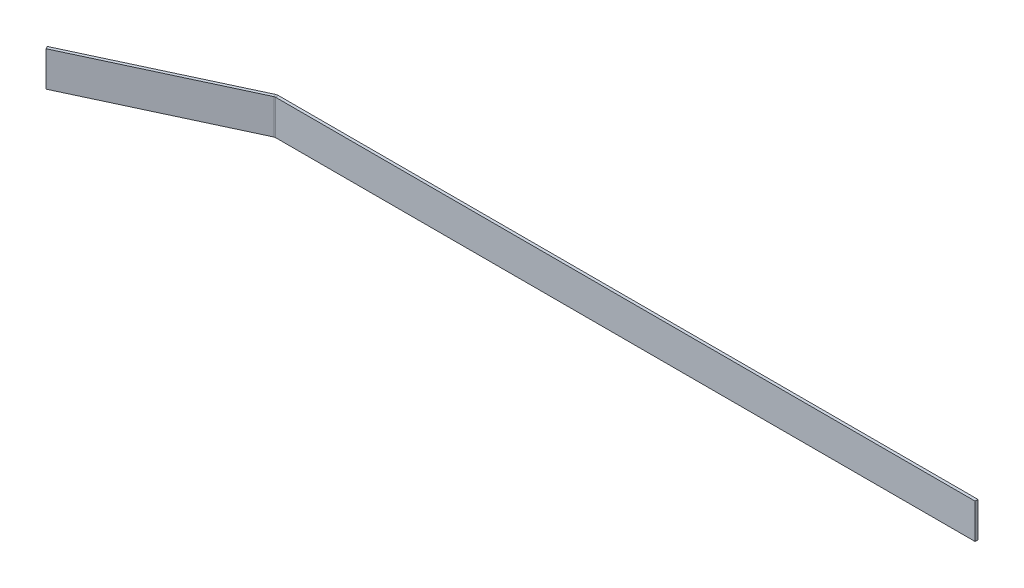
ISO-10303-21;
HEADER;
FILE_DESCRIPTION(('STEP AP214'),'2;1');
FILE_NAME('part.step','',(''),(''),'','','');
FILE_SCHEMA(('AUTOMOTIVE_DESIGN { 1 0 10303 214 1 1 1 1 }'));
ENDSEC;
DATA;
#1=APPLICATION_CONTEXT('core data for automotive mechanical design processes');
#2=APPLICATION_PROTOCOL_DEFINITION('international standard','automotive_design',2000,#1);
#3=PRODUCT_CONTEXT('',#1,'mechanical');
#4=PRODUCT('Part','Part','',(#3));
#5=PRODUCT_RELATED_PRODUCT_CATEGORY('part','',(#4));
#6=PRODUCT_DEFINITION_FORMATION('','',#4);
#7=PRODUCT_DEFINITION_CONTEXT('part definition',#1,'design');
#8=PRODUCT_DEFINITION('design','',#6,#7);
#9=PRODUCT_DEFINITION_SHAPE('','',#8);
#10=(LENGTH_UNIT() NAMED_UNIT(*) SI_UNIT(.MILLI.,.METRE.));
#11=(NAMED_UNIT(*) PLANE_ANGLE_UNIT() SI_UNIT($,.RADIAN.));
#12=(NAMED_UNIT(*) SI_UNIT($,.STERADIAN.) SOLID_ANGLE_UNIT());
#13=UNCERTAINTY_MEASURE_WITH_UNIT(LENGTH_MEASURE(1.E-05),#10,'distance_accuracy_value','');
#14=(GEOMETRIC_REPRESENTATION_CONTEXT(3) GLOBAL_UNCERTAINTY_ASSIGNED_CONTEXT((#13)) GLOBAL_UNIT_ASSIGNED_CONTEXT((#10,
#11,#12)) REPRESENTATION_CONTEXT('',''));
#15=CARTESIAN_POINT('',(0.,0.,0.));
#16=DIRECTION('',(0.,0.,1.));
#17=DIRECTION('',(1.,0.,0.));
#18=AXIS2_PLACEMENT_3D('',#15,#16,#17);
#19=CARTESIAN_POINT('',(1.40776110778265,-76.2,0.));
#20=DIRECTION('',(0.,-1.,0.));
#21=DIRECTION('',(0.,0.,-1.));
#22=AXIS2_PLACEMENT_3D('',#19,#20,#21);
#23=PLANE('',#22);
#24=DIRECTION('',(0.,0.,-1.));
#25=VECTOR('',#24,1.);
#26=CARTESIAN_POINT('',(1.40776110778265,-76.2,0.));
#27=LINE('',#26,#25);
#28=CARTESIAN_POINT('',(1.40776110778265,-76.2,0.));
#29=VERTEX_POINT('',#28);
#30=CARTESIAN_POINT('',(1.40776110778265,-76.2,-6.35));
#31=VERTEX_POINT('',#30);
#32=EDGE_CURVE('E11',#29,#31,#27,.T.);
#33=ORIENTED_EDGE('',*,*,#32,.F.);
#34=CARTESIAN_POINT('',(1.40776110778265,-76.2,6.35));
#35=DIRECTION('',(0.,-1.,0.));
#36=DIRECTION('',(0.,0.,-1.));
#37=AXIS2_PLACEMENT_3D('',#34,#35,#36);
#38=CIRCLE('',#37,6.35);
#39=CARTESIAN_POINT('',(-1.27586485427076,-76.2,0.594945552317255));
#40=VERTEX_POINT('',#39);
#41=EDGE_CURVE('E182',#29,#40,#38,.F.);
#42=ORIENTED_EDGE('',*,*,#41,.T.);
#43=DIRECTION('',(0.422618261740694,0.,0.906307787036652));
#44=VECTOR('',#43,1.);
#45=CARTESIAN_POINT('',(-3.95949081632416,-76.2,-5.16010889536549));
#46=LINE('',#45,#44);
#47=CARTESIAN_POINT('',(-3.95949081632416,-76.2,-5.16010889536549));
#48=VERTEX_POINT('',#47);
#49=EDGE_CURVE('E46',#48,#40,#46,.T.);
#50=ORIENTED_EDGE('',*,*,#49,.F.);
#51=CARTESIAN_POINT('',(1.40776110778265,-76.2,6.35));
#52=DIRECTION('',(0.,1.,0.));
#53=DIRECTION('',(1.,0.,0.));
#54=AXIS2_PLACEMENT_3D('',#51,#52,#53);
#55=CIRCLE('',#54,12.7);
#56=EDGE_CURVE('E135',#31,#48,#55,.T.);
#57=ORIENTED_EDGE('',*,*,#56,.F.);
#58=EDGE_LOOP('',(#33,#42,#50,#57));
#59=FACE_BOUND('',#58,.T.);
#60=ADVANCED_FACE('F38',(#59),#23,.T.);
#61=CARTESIAN_POINT('',(-3.95949081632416,-76.2,-5.16010889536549));
#62=DIRECTION('',(0.,-1.,0.));
#63=DIRECTION('',(0.,0.,-1.));
#64=AXIS2_PLACEMENT_3D('',#61,#62,#63);
#65=PLANE('',#64);
#66=DIRECTION('',(-1.,0.,0.));
#67=VECTOR('',#66,1.);
#68=CARTESIAN_POINT('',(0.,-76.2,0.));
#69=LINE('',#68,#67);
#70=CARTESIAN_POINT('',(1524.,-76.2,0.));
#71=VERTEX_POINT('',#70);
#72=EDGE_CURVE('E131',#71,#29,#69,.T.);
#73=ORIENTED_EDGE('',*,*,#72,.T.);
#74=ORIENTED_EDGE('',*,*,#32,.T.);
#75=DIRECTION('',(1.,0.,0.));
#76=VECTOR('',#75,1.);
#77=CARTESIAN_POINT('',(0.,-76.2,-6.35));
#78=LINE('',#77,#76);
#79=CARTESIAN_POINT('',(1524.,-76.2,-6.35));
#80=VERTEX_POINT('',#79);
#81=EDGE_CURVE('E116',#80,#31,#78,.F.);
#82=ORIENTED_EDGE('',*,*,#81,.F.);
#83=DIRECTION('',(0.,0.,1.));
#84=VECTOR('',#83,1.);
#85=CARTESIAN_POINT('',(1524.,-76.2,-6.35));
#86=LINE('',#85,#84);
#87=EDGE_CURVE('E125',#80,#71,#86,.T.);
#88=ORIENTED_EDGE('',*,*,#87,.T.);
#89=EDGE_LOOP('',(#73,#74,#82,#88));
#90=FACE_BOUND('',#89,.T.);
#91=ADVANCED_FACE('F133',(#90),#65,.T.);
#92=CARTESIAN_POINT('',(-1.27586485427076,0.,0.594945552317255));
#93=DIRECTION('',(0.,1.,0.));
#94=DIRECTION('',(0.,0.,1.));
#95=AXIS2_PLACEMENT_3D('',#92,#93,#94);
#96=PLANE('',#95);
#97=DIRECTION('',(-0.422618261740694,0.,-0.906307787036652));
#98=VECTOR('',#97,1.);
#99=CARTESIAN_POINT('',(-1.27586485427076,0.,0.594945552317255));
#100=LINE('',#99,#98);
#101=CARTESIAN_POINT('',(-1.27586485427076,0.,0.594945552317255));
#102=VERTEX_POINT('',#101);
#103=CARTESIAN_POINT('',(-3.95949081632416,0.,-5.16010889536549));
#104=VERTEX_POINT('',#103);
#105=EDGE_CURVE('E88',#102,#104,#100,.T.);
#106=ORIENTED_EDGE('',*,*,#105,.F.);
#107=CARTESIAN_POINT('',(1.40776110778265,0.,6.35));
#108=DIRECTION('',(0.,-1.,0.));
#109=DIRECTION('',(0.,0.,-1.));
#110=AXIS2_PLACEMENT_3D('',#107,#108,#109);
#111=CIRCLE('',#110,6.35);
#112=CARTESIAN_POINT('',(1.40776110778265,0.,0.));
#113=VERTEX_POINT('',#112);
#114=EDGE_CURVE('E149',#113,#102,#111,.F.);
#115=ORIENTED_EDGE('',*,*,#114,.F.);
#116=DIRECTION('',(0.,0.,1.));
#117=VECTOR('',#116,1.);
#118=CARTESIAN_POINT('',(1.40776110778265,0.,-6.35));
#119=LINE('',#118,#117);
#120=CARTESIAN_POINT('',(1.40776110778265,0.,-6.35));
#121=VERTEX_POINT('',#120);
#122=EDGE_CURVE('E81',#121,#113,#119,.T.);
#123=ORIENTED_EDGE('',*,*,#122,.F.);
#124=CARTESIAN_POINT('',(1.40776110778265,0.,6.35));
#125=DIRECTION('',(0.,1.,0.));
#126=DIRECTION('',(1.,0.,0.));
#127=AXIS2_PLACEMENT_3D('',#124,#125,#126);
#128=CIRCLE('',#127,12.7);
#129=EDGE_CURVE('E158',#121,#104,#128,.T.);
#130=ORIENTED_EDGE('',*,*,#129,.T.);
#131=EDGE_LOOP('',(#106,#115,#123,#130));
#132=FACE_BOUND('',#131,.T.);
#133=ADVANCED_FACE('F196',(#132),#96,.T.);
#134=CARTESIAN_POINT('',(1.40776110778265,0.,-6.35));
#135=DIRECTION('',(0.,1.,0.));
#136=DIRECTION('',(0.,0.,1.));
#137=AXIS2_PLACEMENT_3D('',#134,#135,#136);
#138=PLANE('',#137);
#139=DIRECTION('',(-0.906307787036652,0.,0.422618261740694));
#140=VECTOR('',#139,1.);
#141=CARTESIAN_POINT('',(0.,0.,0.));
#142=LINE('',#141,#140);
#143=CARTESIAN_POINT('',(-339.548212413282,0.,158.333931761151));
#144=VERTEX_POINT('',#143);
#145=EDGE_CURVE('E147',#102,#144,#142,.T.);
#146=ORIENTED_EDGE('',*,*,#145,.F.);
#147=ORIENTED_EDGE('',*,*,#105,.T.);
#148=DIRECTION('',(-0.906307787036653,0.,0.422618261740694));
#149=VECTOR('',#148,1.);
#150=CARTESIAN_POINT('',(-2.68362596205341,0.,-5.75505444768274));
#151=LINE('',#150,#149);
#152=CARTESIAN_POINT('',(-342.231838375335,0.,152.578877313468));
#153=VERTEX_POINT('',#152);
#154=EDGE_CURVE('E142',#104,#153,#151,.T.);
#155=ORIENTED_EDGE('',*,*,#154,.T.);
#156=DIRECTION('',(-0.422618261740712,0.,-0.906307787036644));
#157=VECTOR('',#156,1.);
#158=CARTESIAN_POINT('',(-339.548212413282,0.,158.333931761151));
#159=LINE('',#158,#157);
#160=EDGE_CURVE('E144',#144,#153,#159,.T.);
#161=ORIENTED_EDGE('',*,*,#160,.F.);
#162=EDGE_LOOP('',(#146,#147,#155,#161));
#163=FACE_BOUND('',#162,.T.);
#164=ADVANCED_FACE('F204',(#163),#138,.T.);
#165=CARTESIAN_POINT('',(-2.68362596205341,-76.2,-5.75505444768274));
#166=DIRECTION('',(-0.422618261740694,0.,-0.906307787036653));
#167=DIRECTION('',(-0.906307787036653,0.,0.422618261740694));
#168=AXIS2_PLACEMENT_3D('',#165,#166,#167);
#169=PLANE('',#168);
#170=ORIENTED_EDGE('',*,*,#154,.F.);
#171=DIRECTION('',(0.,1.,0.));
#172=VECTOR('',#171,1.);
#173=CARTESIAN_POINT('',(-3.95949081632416,-76.2,-5.16010889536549));
#174=LINE('',#173,#172);
#175=EDGE_CURVE('E161',#48,#104,#174,.T.);
#176=ORIENTED_EDGE('',*,*,#175,.F.);
#177=DIRECTION('',(-0.906307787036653,0.,0.422618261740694));
#178=VECTOR('',#177,1.);
#179=CARTESIAN_POINT('',(-2.68362596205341,-76.2,-5.75505444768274));
#180=LINE('',#179,#178);
#181=CARTESIAN_POINT('',(-342.231838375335,-76.2,152.578877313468));
#182=VERTEX_POINT('',#181);
#183=EDGE_CURVE('E160',#48,#182,#180,.T.);
#184=ORIENTED_EDGE('',*,*,#183,.T.);
#185=DIRECTION('',(0.,1.,0.));
#186=VECTOR('',#185,1.);
#187=CARTESIAN_POINT('',(-342.231838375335,-76.2,152.578877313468));
#188=LINE('',#187,#186);
#189=EDGE_CURVE('E138',#182,#153,#188,.T.);
#190=ORIENTED_EDGE('',*,*,#189,.T.);
#191=EDGE_LOOP('',(#170,#176,#184,#190));
#192=FACE_BOUND('',#191,.T.);
#193=ADVANCED_FACE('F202',(#192),#169,.T.);
#194=CARTESIAN_POINT('',(1.40776110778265,-76.2,6.35));
#195=DIRECTION('',(0.,1.,0.));
#196=DIRECTION('',(0.,0.,1.));
#197=AXIS2_PLACEMENT_3D('',#194,#195,#196);
#198=CYLINDRICAL_SURFACE('',#197,12.7);
#199=ORIENTED_EDGE('',*,*,#129,.F.);
#200=DIRECTION('',(0.,1.,0.));
#201=VECTOR('',#200,1.);
#202=CARTESIAN_POINT('',(1.40776110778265,-76.2,-6.35));
#203=LINE('',#202,#201);
#204=EDGE_CURVE('E121',#31,#121,#203,.T.);
#205=ORIENTED_EDGE('',*,*,#204,.F.);
#206=ORIENTED_EDGE('',*,*,#56,.T.);
#207=ORIENTED_EDGE('',*,*,#175,.T.);
#208=EDGE_LOOP('',(#199,#205,#206,#207));
#209=FACE_BOUND('',#208,.T.);
#210=ADVANCED_FACE('F199',(#209),#198,.T.);
#211=CARTESIAN_POINT('',(0.,-76.2,-6.35));
#212=DIRECTION('',(0.,0.,-1.));
#213=DIRECTION('',(-1.,0.,0.));
#214=AXIS2_PLACEMENT_3D('',#211,#212,#213);
#215=PLANE('',#214);
#216=DIRECTION('',(1.,0.,0.));
#217=VECTOR('',#216,1.);
#218=CARTESIAN_POINT('',(0.,0.,-6.35));
#219=LINE('',#218,#217);
#220=CARTESIAN_POINT('',(1524.,0.,-6.35));
#221=VERTEX_POINT('',#220);
#222=EDGE_CURVE('E118',#221,#121,#219,.F.);
#223=ORIENTED_EDGE('',*,*,#222,.F.);
#224=DIRECTION('',(0.,1.,0.));
#225=VECTOR('',#224,1.);
#226=CARTESIAN_POINT('',(1524.,-76.2,-6.35));
#227=LINE('',#226,#225);
#228=EDGE_CURVE('E112',#80,#221,#227,.T.);
#229=ORIENTED_EDGE('',*,*,#228,.F.);
#230=ORIENTED_EDGE('',*,*,#81,.T.);
#231=ORIENTED_EDGE('',*,*,#204,.T.);
#232=EDGE_LOOP('',(#223,#229,#230,#231));
#233=FACE_BOUND('',#232,.T.);
#234=ADVANCED_FACE('F114',(#233),#215,.T.);
#235=CARTESIAN_POINT('',(1524.,-76.2,-6.35));
#236=DIRECTION('',(-1.,0.,0.));
#237=DIRECTION('',(0.,0.,1.));
#238=AXIS2_PLACEMENT_3D('',#235,#236,#237);
#239=PLANE('',#238);
#240=DIRECTION('',(0.,0.,1.));
#241=VECTOR('',#240,1.);
#242=CARTESIAN_POINT('',(1524.,0.,-6.35));
#243=LINE('',#242,#241);
#244=CARTESIAN_POINT('',(1524.,0.,0.));
#245=VERTEX_POINT('',#244);
#246=EDGE_CURVE('E155',#221,#245,#243,.T.);
#247=ORIENTED_EDGE('',*,*,#246,.T.);
#248=DIRECTION('',(0.,1.,0.));
#249=VECTOR('',#248,1.);
#250=CARTESIAN_POINT('',(1524.,-76.2,0.));
#251=LINE('',#250,#249);
#252=EDGE_CURVE('E122',#71,#245,#251,.T.);
#253=ORIENTED_EDGE('',*,*,#252,.F.);
#254=ORIENTED_EDGE('',*,*,#87,.F.);
#255=ORIENTED_EDGE('',*,*,#228,.T.);
#256=EDGE_LOOP('',(#247,#253,#254,#255));
#257=FACE_BOUND('',#256,.T.);
#258=ADVANCED_FACE('F126',(#257),#239,.F.);
#259=CARTESIAN_POINT('',(0.,-76.2,0.));
#260=DIRECTION('',(0.,0.,-1.));
#261=DIRECTION('',(-1.,0.,0.));
#262=AXIS2_PLACEMENT_3D('',#259,#260,#261);
#263=PLANE('',#262);
#264=DIRECTION('',(-1.,0.,0.));
#265=VECTOR('',#264,1.);
#266=CARTESIAN_POINT('',(0.,0.,0.));
#267=LINE('',#266,#265);
#268=EDGE_CURVE('E152',#245,#113,#267,.T.);
#269=ORIENTED_EDGE('',*,*,#268,.T.);
#270=DIRECTION('',(0.,1.,0.));
#271=VECTOR('',#270,1.);
#272=CARTESIAN_POINT('',(1.40776110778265,-76.2,0.));
#273=LINE('',#272,#271);
#274=EDGE_CURVE('E165',#29,#113,#273,.T.);
#275=ORIENTED_EDGE('',*,*,#274,.F.);
#276=ORIENTED_EDGE('',*,*,#72,.F.);
#277=ORIENTED_EDGE('',*,*,#252,.T.);
#278=EDGE_LOOP('',(#269,#275,#276,#277));
#279=FACE_BOUND('',#278,.T.);
#280=ADVANCED_FACE('F194',(#279),#263,.F.);
#281=CARTESIAN_POINT('',(1.40776110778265,-76.2,6.35));
#282=DIRECTION('',(0.,1.,0.));
#283=DIRECTION('',(0.,0.,1.));
#284=AXIS2_PLACEMENT_3D('',#281,#282,#283);
#285=CYLINDRICAL_SURFACE('',#284,6.35);
#286=ORIENTED_EDGE('',*,*,#114,.T.);
#287=DIRECTION('',(0.,1.,0.));
#288=VECTOR('',#287,1.);
#289=CARTESIAN_POINT('',(-1.27586485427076,-76.2,0.594945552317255));
#290=LINE('',#289,#288);
#291=EDGE_CURVE('E168',#40,#102,#290,.T.);
#292=ORIENTED_EDGE('',*,*,#291,.F.);
#293=ORIENTED_EDGE('',*,*,#41,.F.);
#294=ORIENTED_EDGE('',*,*,#274,.T.);
#295=EDGE_LOOP('',(#286,#292,#293,#294));
#296=FACE_BOUND('',#295,.T.);
#297=ADVANCED_FACE('F186',(#296),#285,.F.);
#298=CARTESIAN_POINT('',(0.,-76.2,0.));
#299=DIRECTION('',(-0.422618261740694,0.,-0.906307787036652));
#300=DIRECTION('',(-0.906307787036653,0.,0.422618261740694));
#301=AXIS2_PLACEMENT_3D('',#298,#299,#300);
#302=PLANE('',#301);
#303=ORIENTED_EDGE('',*,*,#145,.T.);
#304=DIRECTION('',(0.,1.,0.));
#305=VECTOR('',#304,1.);
#306=CARTESIAN_POINT('',(-339.548212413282,-76.2,158.333931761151));
#307=LINE('',#306,#305);
#308=CARTESIAN_POINT('',(-339.548212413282,-76.2,158.333931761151));
#309=VERTEX_POINT('',#308);
#310=EDGE_CURVE('E171',#309,#144,#307,.T.);
#311=ORIENTED_EDGE('',*,*,#310,.F.);
#312=DIRECTION('',(-0.906307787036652,0.,0.422618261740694));
#313=VECTOR('',#312,1.);
#314=CARTESIAN_POINT('',(0.,-76.2,0.));
#315=LINE('',#314,#313);
#316=EDGE_CURVE('E178',#40,#309,#315,.T.);
#317=ORIENTED_EDGE('',*,*,#316,.F.);
#318=ORIENTED_EDGE('',*,*,#291,.T.);
#319=EDGE_LOOP('',(#303,#311,#317,#318));
#320=FACE_BOUND('',#319,.T.);
#321=ADVANCED_FACE('F188',(#320),#302,.F.);
#322=CARTESIAN_POINT('',(-339.548212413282,-76.2,158.333931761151));
#323=DIRECTION('',(0.906307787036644,0.,-0.422618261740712));
#324=DIRECTION('',(-0.422618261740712,0.,-0.906307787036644));
#325=AXIS2_PLACEMENT_3D('',#322,#323,#324);
#326=PLANE('',#325);
#327=ORIENTED_EDGE('',*,*,#160,.T.);
#328=ORIENTED_EDGE('',*,*,#189,.F.);
#329=DIRECTION('',(-0.422618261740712,0.,-0.906307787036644));
#330=VECTOR('',#329,1.);
#331=CARTESIAN_POINT('',(-339.548212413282,-76.2,158.333931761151));
#332=LINE('',#331,#330);
#333=EDGE_CURVE('E97',#309,#182,#332,.T.);
#334=ORIENTED_EDGE('',*,*,#333,.F.);
#335=ORIENTED_EDGE('',*,*,#310,.T.);
#336=EDGE_LOOP('',(#327,#328,#334,#335));
#337=FACE_BOUND('',#336,.T.);
#338=ADVANCED_FACE('F206',(#337),#326,.F.);
#339=CARTESIAN_POINT('',(1.40776110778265,-76.2,6.35));
#340=DIRECTION('',(0.,-1.,0.));
#341=DIRECTION('',(-1.,0.,0.));
#342=AXIS2_PLACEMENT_3D('',#339,#340,#341);
#343=PLANE('',#342);
#344=ORIENTED_EDGE('',*,*,#183,.F.);
#345=ORIENTED_EDGE('',*,*,#49,.T.);
#346=ORIENTED_EDGE('',*,*,#316,.T.);
#347=ORIENTED_EDGE('',*,*,#333,.T.);
#348=EDGE_LOOP('',(#344,#345,#346,#347));
#349=FACE_BOUND('',#348,.T.);
#350=ADVANCED_FACE('F176',(#349),#343,.T.);
#351=CARTESIAN_POINT('',(1.40776110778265,0.,6.35));
#352=DIRECTION('',(0.,-1.,0.));
#353=DIRECTION('',(-1.,0.,0.));
#354=AXIS2_PLACEMENT_3D('',#351,#352,#353);
#355=PLANE('',#354);
#356=ORIENTED_EDGE('',*,*,#222,.T.);
#357=ORIENTED_EDGE('',*,*,#122,.T.);
#358=ORIENTED_EDGE('',*,*,#268,.F.);
#359=ORIENTED_EDGE('',*,*,#246,.F.);
#360=EDGE_LOOP('',(#356,#357,#358,#359));
#361=FACE_BOUND('',#360,.T.);
#362=ADVANCED_FACE('F213',(#361),#355,.F.);
#363=CLOSED_SHELL('',(#60,#91,#133,#164,#193,#210,#234,#258,#280,#297,#321,#338,#350,#362));
#364=MANIFOLD_SOLID_BREP('B2',#363);
#365=ADVANCED_BREP_SHAPE_REPRESENTATION('',(#18,#364),#14);
#366=SHAPE_DEFINITION_REPRESENTATION(#9,#365);
ENDSEC;
END-ISO-10303-21;
